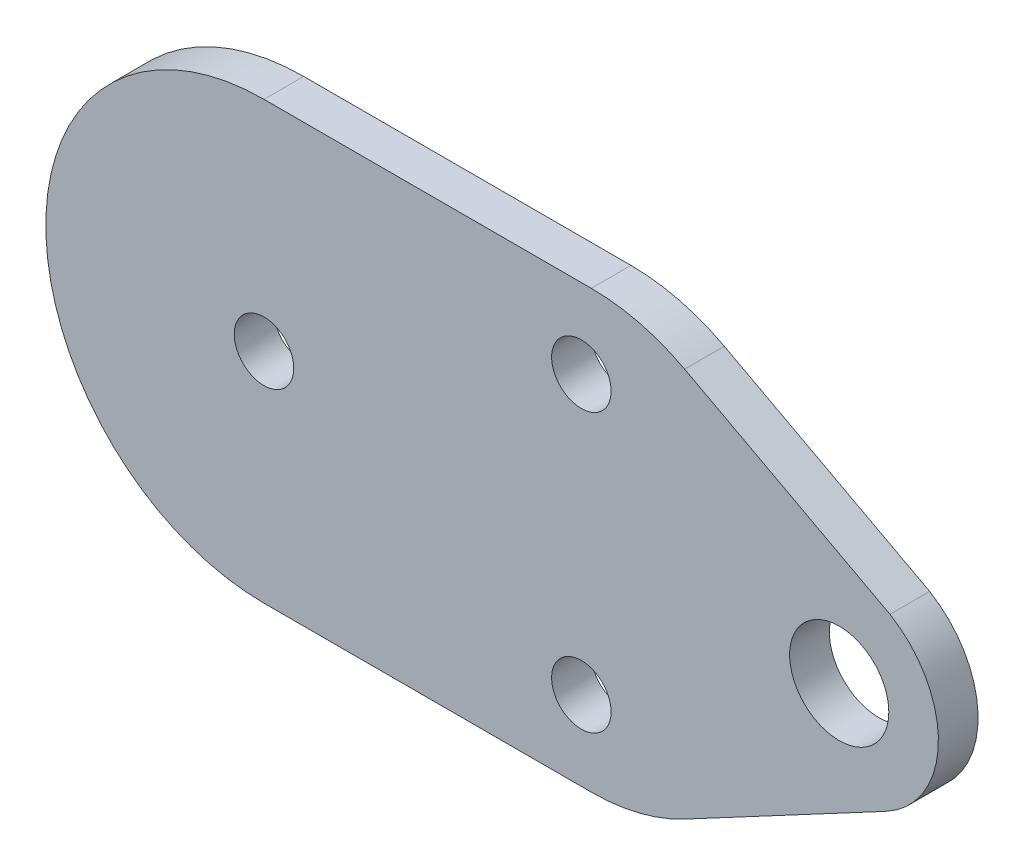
from build123d import *

# Parameters (mm, degrees)
ESQUISSE1_R      = 1.5
ESQUISSE1_R_2    = 2.5
EXTRUSION1_DEPTH = 2
CONG_1_R         = 10


with BuildPart() as part:
    # Esquisse1 → Extrusion1 (new body)
    with BuildSketch(Plane.XY):
        with BuildLine():
            Line((0, 11), (19, 11))
            Line((19, 11), (31.5585355, 4.29579982))
            ThreePointArc((31.5585355, 4.29579982), (33.998606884, -0.118022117), (31.352941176, -4.411764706))
            Line((31.352941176, -4.411764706), (19, -11))
            Line((19, -11), (0, -11))
            ThreePointArc((0, -11), (-11, 0), (0, 11))
        make_face()
        with Locations((16, 7)):
            Circle(ESQUISSE1_R, mode=Mode.SUBTRACT)
        Circle(ESQUISSE1_R, mode=Mode.SUBTRACT)
        with Locations(Location((16, -7, 0), (0, 0, 180))):
            Circle(ESQUISSE1_R, mode=Mode.SUBTRACT)
        with Locations((29, 0)):
            Circle(ESQUISSE1_R_2, mode=Mode.SUBTRACT)
    extrude(amount=EXTRUSION1_DEPTH)

    # Cong_1
    cong_1_edges = [part.edges().sort_by_distance(p)[0] for p in [
        (19, -11, 1),
        (19, 11, 1),
    ]]
    fillet(cong_1_edges, radius=CONG_1_R)


solid = part.part
